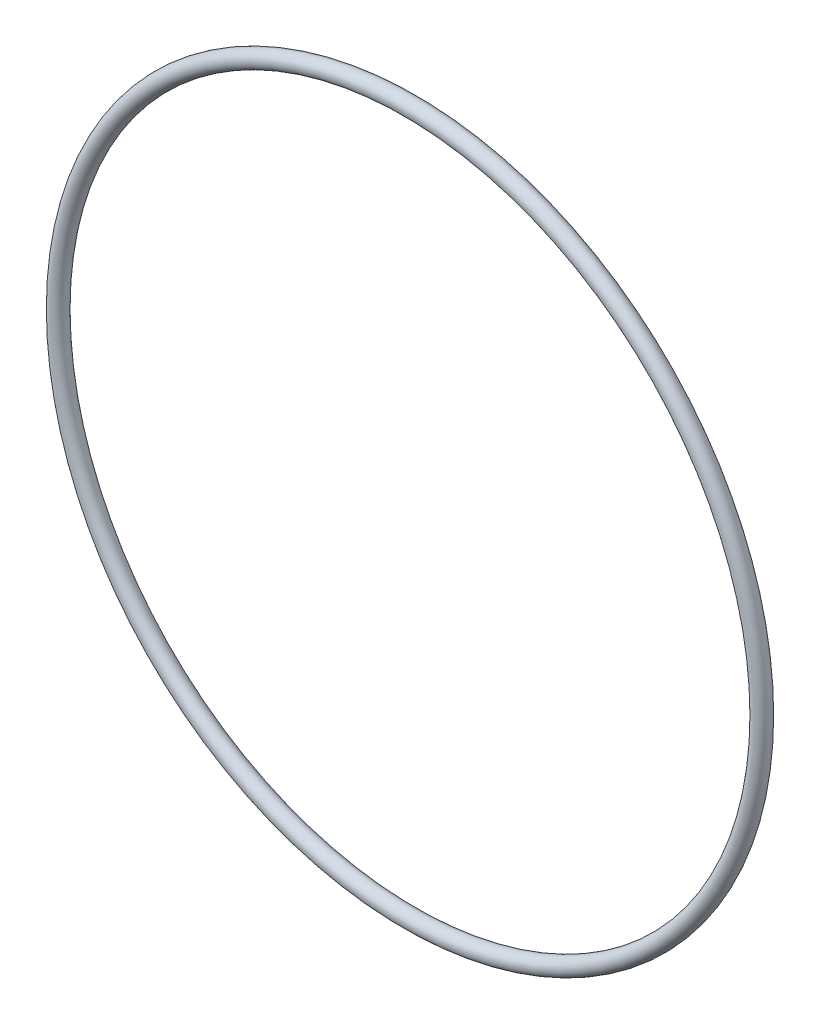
from build123d import *

# Parameters (mm, degrees)
SKETCH1_R = 0.889


with BuildPart() as part:
    # Sweep1: sweep along a path in Sketch3
    with BuildLine(Plane.XY) as sweep1_path:
        CenterArc((37.2618, 0), 37.2618, 0, 360)
    # Sketch1 → Sweep1 (sweep)
    with BuildSketch(Plane(origin=(0, 0, 0), x_dir=(1, 0, 0), z_dir=(0, 1, 0))):
        Circle(SKETCH1_R)
    sweep(path=sweep1_path.line)


solid = part.part
